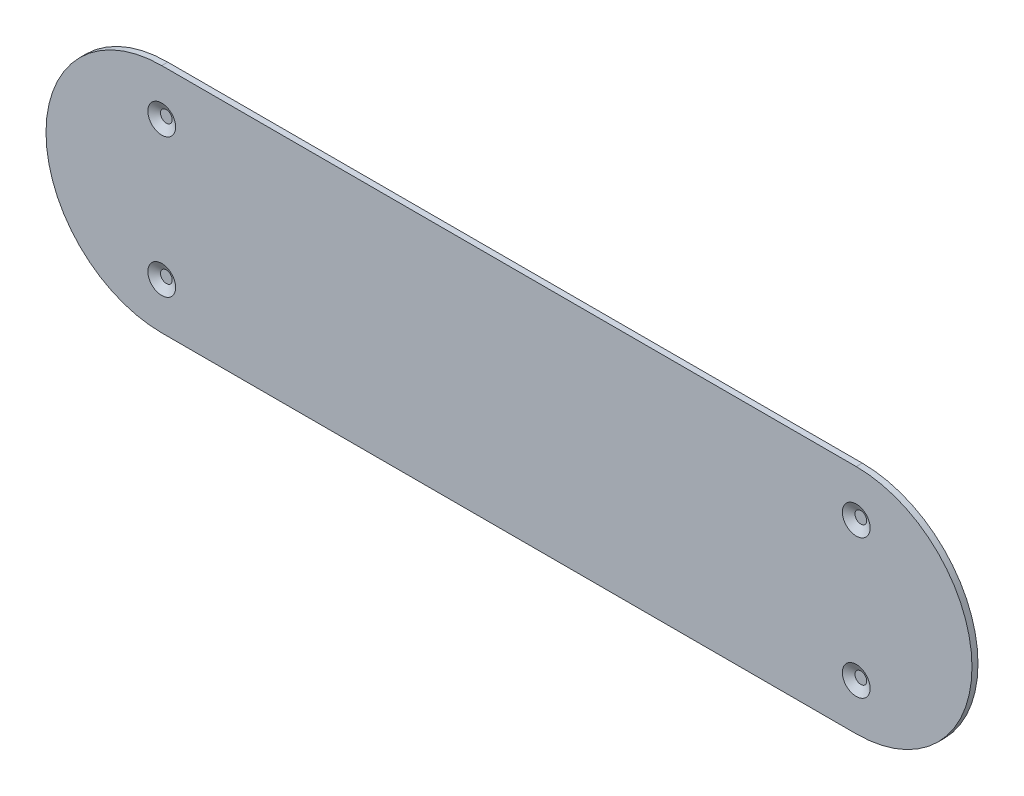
ISO-10303-21;
HEADER;
FILE_DESCRIPTION(('STEP AP214'),'2;1');
FILE_NAME('part.step','',(''),(''),'','','');
FILE_SCHEMA(('AUTOMOTIVE_DESIGN { 1 0 10303 214 1 1 1 1 }'));
ENDSEC;
DATA;
#1=APPLICATION_CONTEXT('core data for automotive mechanical design processes');
#2=APPLICATION_PROTOCOL_DEFINITION('international standard','automotive_design',2000,#1);
#3=PRODUCT_CONTEXT('',#1,'mechanical');
#4=PRODUCT('Part','Part','',(#3));
#5=PRODUCT_RELATED_PRODUCT_CATEGORY('part','',(#4));
#6=PRODUCT_DEFINITION_FORMATION('','',#4);
#7=PRODUCT_DEFINITION_CONTEXT('part definition',#1,'design');
#8=PRODUCT_DEFINITION('design','',#6,#7);
#9=PRODUCT_DEFINITION_SHAPE('','',#8);
#10=(LENGTH_UNIT() NAMED_UNIT(*) SI_UNIT(.MILLI.,.METRE.));
#11=(NAMED_UNIT(*) PLANE_ANGLE_UNIT() SI_UNIT($,.RADIAN.));
#12=(NAMED_UNIT(*) SI_UNIT($,.STERADIAN.) SOLID_ANGLE_UNIT());
#13=UNCERTAINTY_MEASURE_WITH_UNIT(LENGTH_MEASURE(1.E-05),#10,'distance_accuracy_value','');
#14=(GEOMETRIC_REPRESENTATION_CONTEXT(3) GLOBAL_UNCERTAINTY_ASSIGNED_CONTEXT((#13)) GLOBAL_UNIT_ASSIGNED_CONTEXT((#10,
#11,#12)) REPRESENTATION_CONTEXT('',''));
#15=CARTESIAN_POINT('',(0.,0.,0.));
#16=DIRECTION('',(0.,0.,1.));
#17=DIRECTION('',(1.,0.,0.));
#18=AXIS2_PLACEMENT_3D('',#15,#16,#17);
#19=CARTESIAN_POINT('',(7.50000000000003,1.5,0.03));
#20=DIRECTION('',(0.,0.,1.));
#21=DIRECTION('',(1.,0.,0.));
#22=AXIS2_PLACEMENT_3D('',#19,#20,#21);
#23=PLANE('',#22);
#24=CARTESIAN_POINT('',(7.50000000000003,1.5,0.0300000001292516));
#25=DIRECTION('',(0.,0.,1.));
#26=DIRECTION('',(1.,0.,0.));
#27=AXIS2_PLACEMENT_3D('',#24,#25,#26);
#28=CIRCLE('',#27,0.126794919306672);
#29=CARTESIAN_POINT('',(7.6267949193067,1.5,0.0300000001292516));
#30=VERTEX_POINT('',#29);
#31=EDGE_CURVE('E19',#30,#30,#28,.T.);
#32=ORIENTED_EDGE('',*,*,#31,.T.);
#33=EDGE_LOOP('',(#32));
#34=FACE_BOUND('',#33,.T.);
#35=ADVANCED_FACE('F16',(#34),#23,.T.);
#36=CARTESIAN_POINT('',(7.50000000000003,-1.5,0.03));
#37=DIRECTION('',(0.,0.,1.));
#38=DIRECTION('',(1.,0.,0.));
#39=AXIS2_PLACEMENT_3D('',#36,#37,#38);
#40=PLANE('',#39);
#41=CARTESIAN_POINT('',(7.50000000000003,-1.5,0.0300000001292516));
#42=DIRECTION('',(0.,0.,1.));
#43=DIRECTION('',(1.,0.,0.));
#44=AXIS2_PLACEMENT_3D('',#41,#42,#43);
#45=CIRCLE('',#44,0.126794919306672);
#46=CARTESIAN_POINT('',(7.6267949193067,-1.5,0.0300000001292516));
#47=VERTEX_POINT('',#46);
#48=EDGE_CURVE('E104',#47,#47,#45,.T.);
#49=ORIENTED_EDGE('',*,*,#48,.T.);
#50=EDGE_LOOP('',(#49));
#51=FACE_BOUND('',#50,.T.);
#52=ADVANCED_FACE('F164',(#51),#40,.T.);
#53=CARTESIAN_POINT('',(-7.49999999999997,-1.5,0.03));
#54=DIRECTION('',(0.,0.,1.));
#55=DIRECTION('',(1.,0.,0.));
#56=AXIS2_PLACEMENT_3D('',#53,#54,#55);
#57=PLANE('',#56);
#58=CARTESIAN_POINT('',(-7.49999999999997,-1.5,0.0300000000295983));
#59=DIRECTION('',(0.,0.,1.));
#60=DIRECTION('',(1.,0.,0.));
#61=AXIS2_PLACEMENT_3D('',#58,#59,#60);
#62=CIRCLE('',#61,0.126794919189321);
#63=CARTESIAN_POINT('',(-7.37320508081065,-1.5,0.0300000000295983));
#64=VERTEX_POINT('',#63);
#65=EDGE_CURVE('E102',#64,#64,#62,.T.);
#66=ORIENTED_EDGE('',*,*,#65,.T.);
#67=EDGE_LOOP('',(#66));
#68=FACE_BOUND('',#67,.T.);
#69=ADVANCED_FACE('F126',(#68),#57,.T.);
#70=CARTESIAN_POINT('',(-7.49999999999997,1.5,0.03));
#71=DIRECTION('',(0.,0.,1.));
#72=DIRECTION('',(1.,0.,0.));
#73=AXIS2_PLACEMENT_3D('',#70,#71,#72);
#74=PLANE('',#73);
#75=CARTESIAN_POINT('',(-7.49999999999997,1.5,0.0300000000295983));
#76=DIRECTION('',(0.,0.,1.));
#77=DIRECTION('',(1.,0.,0.));
#78=AXIS2_PLACEMENT_3D('',#75,#76,#77);
#79=CIRCLE('',#78,0.126794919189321);
#80=CARTESIAN_POINT('',(-7.37320508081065,1.5,0.0300000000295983));
#81=VERTEX_POINT('',#80);
#82=EDGE_CURVE('E99',#81,#81,#79,.T.);
#83=ORIENTED_EDGE('',*,*,#82,.T.);
#84=EDGE_LOOP('',(#83));
#85=FACE_BOUND('',#84,.T.);
#86=ADVANCED_FACE('F115',(#85),#74,.T.);
#87=CARTESIAN_POINT('',(7.50000000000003,1.5,0.130000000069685));
#88=DIRECTION('',(0.,0.,1.));
#89=DIRECTION('',(1.,0.,0.));
#90=AXIS2_PLACEMENT_3D('',#87,#88,#89);
#91=CONICAL_SURFACE('',#90,0.29999999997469,1.04719755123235);
#92=CARTESIAN_POINT('',(7.50000000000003,1.5,0.130000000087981));
#93=DIRECTION('',(0.,0.,1.));
#94=DIRECTION('',(1.,0.,0.));
#95=AXIS2_PLACEMENT_3D('',#92,#93,#94);
#96=CIRCLE('',#95,0.300000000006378);
#97=CARTESIAN_POINT('',(7.8000000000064,1.5,0.130000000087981));
#98=VERTEX_POINT('',#97);
#99=EDGE_CURVE('E96',#98,#98,#96,.F.);
#100=ORIENTED_EDGE('',*,*,#99,.F.);
#101=EDGE_LOOP('',(#100));
#102=FACE_BOUND('',#101,.T.);
#103=ORIENTED_EDGE('',*,*,#31,.F.);
#104=EDGE_LOOP('',(#103));
#105=FACE_BOUND('',#104,.T.);
#106=ADVANCED_FACE('F112',(#102,#105),#91,.F.);
#107=CARTESIAN_POINT('',(7.50000000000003,-1.5,0.130000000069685));
#108=DIRECTION('',(0.,0.,1.));
#109=DIRECTION('',(1.,0.,0.));
#110=AXIS2_PLACEMENT_3D('',#107,#108,#109);
#111=CONICAL_SURFACE('',#110,0.29999999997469,1.04719755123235);
#112=CARTESIAN_POINT('',(7.50000000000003,-1.5,0.130000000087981));
#113=DIRECTION('',(0.,0.,1.));
#114=DIRECTION('',(1.,0.,0.));
#115=AXIS2_PLACEMENT_3D('',#112,#113,#114);
#116=CIRCLE('',#115,0.300000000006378);
#117=CARTESIAN_POINT('',(7.8000000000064,-1.5,0.130000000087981));
#118=VERTEX_POINT('',#117);
#119=EDGE_CURVE('E93',#118,#118,#116,.F.);
#120=ORIENTED_EDGE('',*,*,#119,.F.);
#121=EDGE_LOOP('',(#120));
#122=FACE_BOUND('',#121,.T.);
#123=ORIENTED_EDGE('',*,*,#48,.F.);
#124=EDGE_LOOP('',(#123));
#125=FACE_BOUND('',#124,.T.);
#126=ADVANCED_FACE('F114',(#122,#125),#111,.F.);
#127=CARTESIAN_POINT('',(-7.49999999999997,-1.5,0.130000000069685));
#128=DIRECTION('',(0.,0.,1.));
#129=DIRECTION('',(1.,0.,0.));
#130=AXIS2_PLACEMENT_3D('',#127,#128,#129);
#131=CONICAL_SURFACE('',#130,0.299999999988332,1.04719755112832);
#132=CARTESIAN_POINT('',(-7.49999999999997,-1.5,0.13000000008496));
#133=DIRECTION('',(0.,0.,1.));
#134=DIRECTION('',(1.,0.,0.));
#135=AXIS2_PLACEMENT_3D('',#132,#133,#134);
#136=CIRCLE('',#135,0.300000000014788);
#137=CARTESIAN_POINT('',(-7.19999999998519,-1.5,0.13000000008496));
#138=VERTEX_POINT('',#137);
#139=EDGE_CURVE('E90',#138,#138,#136,.F.);
#140=ORIENTED_EDGE('',*,*,#139,.F.);
#141=EDGE_LOOP('',(#140));
#142=FACE_BOUND('',#141,.T.);
#143=ORIENTED_EDGE('',*,*,#65,.F.);
#144=EDGE_LOOP('',(#143));
#145=FACE_BOUND('',#144,.T.);
#146=ADVANCED_FACE('F123',(#142,#145),#131,.F.);
#147=CARTESIAN_POINT('',(-7.49999999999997,1.5,0.130000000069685));
#148=DIRECTION('',(0.,0.,1.));
#149=DIRECTION('',(1.,0.,0.));
#150=AXIS2_PLACEMENT_3D('',#147,#148,#149);
#151=CONICAL_SURFACE('',#150,0.299999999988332,1.04719755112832);
#152=CARTESIAN_POINT('',(-7.49999999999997,1.5,0.13000000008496));
#153=DIRECTION('',(0.,0.,1.));
#154=DIRECTION('',(1.,0.,0.));
#155=AXIS2_PLACEMENT_3D('',#152,#153,#154);
#156=CIRCLE('',#155,0.300000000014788);
#157=CARTESIAN_POINT('',(-7.19999999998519,1.5,0.13000000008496));
#158=VERTEX_POINT('',#157);
#159=EDGE_CURVE('E73',#158,#158,#156,.F.);
#160=ORIENTED_EDGE('',*,*,#159,.F.);
#161=EDGE_LOOP('',(#160));
#162=FACE_BOUND('',#161,.T.);
#163=ORIENTED_EDGE('',*,*,#82,.F.);
#164=EDGE_LOOP('',(#163));
#165=FACE_BOUND('',#164,.T.);
#166=ADVANCED_FACE('F151',(#162,#165),#151,.F.);
#167=CARTESIAN_POINT('',(7.5,0.,0.13));
#168=DIRECTION('',(0.,0.,1.));
#169=DIRECTION('',(1.,0.,0.));
#170=AXIS2_PLACEMENT_3D('',#167,#168,#169);
#171=PLANE('',#170);
#172=CARTESIAN_POINT('',(-7.5,0.,0.13));
#173=DIRECTION('',(0.,0.,-1.));
#174=DIRECTION('',(-1.,0.,0.));
#175=AXIS2_PLACEMENT_3D('',#172,#173,#174);
#176=CIRCLE('',#175,2.5);
#177=CARTESIAN_POINT('',(-7.5,-2.5,0.13));
#178=VERTEX_POINT('',#177);
#179=CARTESIAN_POINT('',(-7.5,2.5,0.13));
#180=VERTEX_POINT('',#179);
#181=EDGE_CURVE('E54',#178,#180,#176,.T.);
#182=ORIENTED_EDGE('',*,*,#181,.F.);
#183=DIRECTION('',(-1.,0.,0.));
#184=VECTOR('',#183,1.);
#185=CARTESIAN_POINT('',(7.5,-2.5,0.13));
#186=LINE('',#185,#184);
#187=CARTESIAN_POINT('',(7.5,-2.5,0.13));
#188=VERTEX_POINT('',#187);
#189=EDGE_CURVE('E82',#178,#188,#186,.F.);
#190=ORIENTED_EDGE('',*,*,#189,.T.);
#191=CARTESIAN_POINT('',(7.5,0.,0.13));
#192=DIRECTION('',(0.,0.,-1.));
#193=DIRECTION('',(-1.,0.,0.));
#194=AXIS2_PLACEMENT_3D('',#191,#192,#193);
#195=CIRCLE('',#194,2.5);
#196=CARTESIAN_POINT('',(7.5,2.5,0.13));
#197=VERTEX_POINT('',#196);
#198=EDGE_CURVE('E69',#197,#188,#195,.T.);
#199=ORIENTED_EDGE('',*,*,#198,.F.);
#200=DIRECTION('',(1.,0.,0.));
#201=VECTOR('',#200,1.);
#202=CARTESIAN_POINT('',(7.5,2.5,0.13));
#203=LINE('',#202,#201);
#204=EDGE_CURVE('E66',#197,#180,#203,.F.);
#205=ORIENTED_EDGE('',*,*,#204,.T.);
#206=EDGE_LOOP('',(#182,#190,#199,#205));
#207=FACE_BOUND('',#206,.T.);
#208=ORIENTED_EDGE('',*,*,#159,.T.);
#209=EDGE_LOOP('',(#208));
#210=FACE_BOUND('',#209,.T.);
#211=ORIENTED_EDGE('',*,*,#139,.T.);
#212=EDGE_LOOP('',(#211));
#213=FACE_BOUND('',#212,.T.);
#214=ORIENTED_EDGE('',*,*,#119,.T.);
#215=EDGE_LOOP('',(#214));
#216=FACE_BOUND('',#215,.T.);
#217=ORIENTED_EDGE('',*,*,#99,.T.);
#218=EDGE_LOOP('',(#217));
#219=FACE_BOUND('',#218,.T.);
#220=ADVANCED_FACE('F67',(#207,#210,#213,#216,#219),#171,.T.);
#221=CARTESIAN_POINT('',(7.5,2.5,0.13));
#222=DIRECTION('',(0.,-1.,0.));
#223=DIRECTION('',(1.,0.,0.));
#224=AXIS2_PLACEMENT_3D('',#221,#222,#223);
#225=PLANE('',#224);
#226=DIRECTION('',(0.,0.,-1.));
#227=VECTOR('',#226,1.);
#228=CARTESIAN_POINT('',(-7.5,2.5,0.13));
#229=LINE('',#228,#227);
#230=CARTESIAN_POINT('',(-7.5,2.5,0.));
#231=VERTEX_POINT('',#230);
#232=EDGE_CURVE('E60',#180,#231,#229,.T.);
#233=ORIENTED_EDGE('',*,*,#232,.F.);
#234=ORIENTED_EDGE('',*,*,#204,.F.);
#235=DIRECTION('',(0.,0.,-1.));
#236=VECTOR('',#235,1.);
#237=CARTESIAN_POINT('',(7.5,2.5,0.13));
#238=LINE('',#237,#236);
#239=CARTESIAN_POINT('',(7.5,2.5,0.));
#240=VERTEX_POINT('',#239);
#241=EDGE_CURVE('E83',#240,#197,#238,.F.);
#242=ORIENTED_EDGE('',*,*,#241,.F.);
#243=DIRECTION('',(1.,0.,0.));
#244=VECTOR('',#243,1.);
#245=CARTESIAN_POINT('',(7.5,2.5,0.));
#246=LINE('',#245,#244);
#247=EDGE_CURVE('E77',#240,#231,#246,.F.);
#248=ORIENTED_EDGE('',*,*,#247,.T.);
#249=EDGE_LOOP('',(#233,#234,#242,#248));
#250=FACE_BOUND('',#249,.T.);
#251=ADVANCED_FACE('F76',(#250),#225,.F.);
#252=CARTESIAN_POINT('',(-7.5,0.,0.13));
#253=DIRECTION('',(0.,0.,-1.));
#254=DIRECTION('',(-1.,0.,0.));
#255=AXIS2_PLACEMENT_3D('',#252,#253,#254);
#256=CYLINDRICAL_SURFACE('',#255,2.5);
#257=CARTESIAN_POINT('',(-7.5,0.,0.));
#258=DIRECTION('',(0.,0.,-1.));
#259=DIRECTION('',(-1.,0.,0.));
#260=AXIS2_PLACEMENT_3D('',#257,#258,#259);
#261=CIRCLE('',#260,2.5);
#262=CARTESIAN_POINT('',(-7.5,-2.5,0.));
#263=VERTEX_POINT('',#262);
#264=EDGE_CURVE('E85',#231,#263,#261,.F.);
#265=ORIENTED_EDGE('',*,*,#264,.T.);
#266=DIRECTION('',(0.,0.,1.));
#267=VECTOR('',#266,1.);
#268=CARTESIAN_POINT('',(-7.5,-2.5,0.13));
#269=LINE('',#268,#267);
#270=EDGE_CURVE('E63',#263,#178,#269,.T.);
#271=ORIENTED_EDGE('',*,*,#270,.T.);
#272=ORIENTED_EDGE('',*,*,#181,.T.);
#273=ORIENTED_EDGE('',*,*,#232,.T.);
#274=EDGE_LOOP('',(#265,#271,#272,#273));
#275=FACE_BOUND('',#274,.T.);
#276=ADVANCED_FACE('F58',(#275),#256,.T.);
#277=CARTESIAN_POINT('',(7.5,-2.5,0.13));
#278=DIRECTION('',(0.,1.,0.));
#279=DIRECTION('',(-1.,0.,0.));
#280=AXIS2_PLACEMENT_3D('',#277,#278,#279);
#281=PLANE('',#280);
#282=DIRECTION('',(0.,0.,-1.));
#283=VECTOR('',#282,1.);
#284=CARTESIAN_POINT('',(7.5,-2.5,0.13));
#285=LINE('',#284,#283);
#286=CARTESIAN_POINT('',(7.5,-2.5,0.));
#287=VERTEX_POINT('',#286);
#288=EDGE_CURVE('E33',#188,#287,#285,.T.);
#289=ORIENTED_EDGE('',*,*,#288,.F.);
#290=ORIENTED_EDGE('',*,*,#189,.F.);
#291=ORIENTED_EDGE('',*,*,#270,.F.);
#292=DIRECTION('',(1.,0.,0.));
#293=VECTOR('',#292,1.);
#294=CARTESIAN_POINT('',(7.5,-2.5,0.));
#295=LINE('',#294,#293);
#296=EDGE_CURVE('E25',#263,#287,#295,.T.);
#297=ORIENTED_EDGE('',*,*,#296,.T.);
#298=EDGE_LOOP('',(#289,#290,#291,#297));
#299=FACE_BOUND('',#298,.T.);
#300=ADVANCED_FACE('F138',(#299),#281,.F.);
#301=CARTESIAN_POINT('',(7.5,0.,0.13));
#302=DIRECTION('',(0.,0.,-1.));
#303=DIRECTION('',(-1.,0.,0.));
#304=AXIS2_PLACEMENT_3D('',#301,#302,#303);
#305=CYLINDRICAL_SURFACE('',#304,2.5);
#306=ORIENTED_EDGE('',*,*,#198,.T.);
#307=ORIENTED_EDGE('',*,*,#288,.T.);
#308=CARTESIAN_POINT('',(7.5,0.,0.));
#309=DIRECTION('',(0.,0.,-1.));
#310=DIRECTION('',(-1.,0.,0.));
#311=AXIS2_PLACEMENT_3D('',#308,#309,#310);
#312=CIRCLE('',#311,2.5);
#313=EDGE_CURVE('E10',#287,#240,#312,.F.);
#314=ORIENTED_EDGE('',*,*,#313,.T.);
#315=ORIENTED_EDGE('',*,*,#241,.T.);
#316=EDGE_LOOP('',(#306,#307,#314,#315));
#317=FACE_BOUND('',#316,.T.);
#318=ADVANCED_FACE('F132',(#317),#305,.T.);
#319=CARTESIAN_POINT('',(7.5,0.,0.));
#320=DIRECTION('',(0.,0.,1.));
#321=DIRECTION('',(1.,0.,0.));
#322=AXIS2_PLACEMENT_3D('',#319,#320,#321);
#323=PLANE('',#322);
#324=ORIENTED_EDGE('',*,*,#296,.F.);
#325=ORIENTED_EDGE('',*,*,#264,.F.);
#326=ORIENTED_EDGE('',*,*,#247,.F.);
#327=ORIENTED_EDGE('',*,*,#313,.F.);
#328=EDGE_LOOP('',(#324,#325,#326,#327));
#329=FACE_BOUND('',#328,.T.);
#330=ADVANCED_FACE('F130',(#329),#323,.F.);
#331=CLOSED_SHELL('',(#35,#52,#69,#86,#106,#126,#146,#166,#220,#251,#276,#300,#318,#330));
#332=MANIFOLD_SOLID_BREP('B1',#331);
#333=ADVANCED_BREP_SHAPE_REPRESENTATION('',(#18,#332),#14);
#334=SHAPE_DEFINITION_REPRESENTATION(#9,#333);
ENDSEC;
END-ISO-10303-21;
